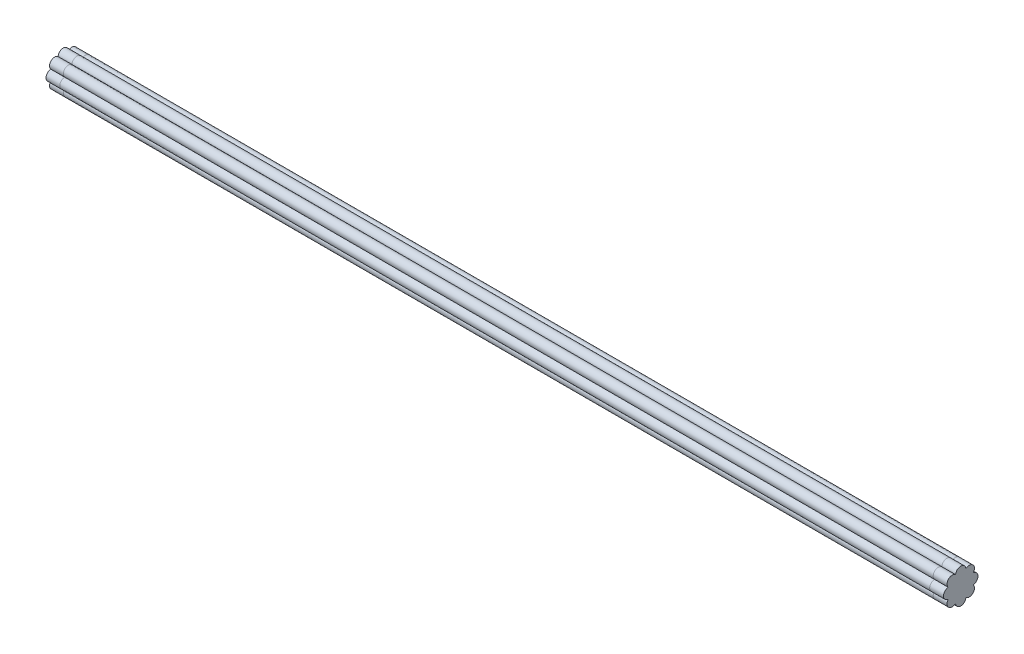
ISO-10303-21;
HEADER;
FILE_DESCRIPTION(('STEP AP214'),'2;1');
FILE_NAME('part.step','',(''),(''),'','','');
FILE_SCHEMA(('AUTOMOTIVE_DESIGN { 1 0 10303 214 1 1 1 1 }'));
ENDSEC;
DATA;
#1=APPLICATION_CONTEXT('core data for automotive mechanical design processes');
#2=APPLICATION_PROTOCOL_DEFINITION('international standard','automotive_design',2000,#1);
#3=PRODUCT_CONTEXT('',#1,'mechanical');
#4=PRODUCT('Part','Part','',(#3));
#5=PRODUCT_RELATED_PRODUCT_CATEGORY('part','',(#4));
#6=PRODUCT_DEFINITION_FORMATION('','',#4);
#7=PRODUCT_DEFINITION_CONTEXT('part definition',#1,'design');
#8=PRODUCT_DEFINITION('design','',#6,#7);
#9=PRODUCT_DEFINITION_SHAPE('','',#8);
#10=(LENGTH_UNIT() NAMED_UNIT(*) SI_UNIT(.MILLI.,.METRE.));
#11=(NAMED_UNIT(*) PLANE_ANGLE_UNIT() SI_UNIT($,.RADIAN.));
#12=(NAMED_UNIT(*) SI_UNIT($,.STERADIAN.) SOLID_ANGLE_UNIT());
#13=UNCERTAINTY_MEASURE_WITH_UNIT(LENGTH_MEASURE(1.E-05),#10,'distance_accuracy_value','');
#14=(GEOMETRIC_REPRESENTATION_CONTEXT(3) GLOBAL_UNCERTAINTY_ASSIGNED_CONTEXT((#13)) GLOBAL_UNIT_ASSIGNED_CONTEXT((#10,
#11,#12)) REPRESENTATION_CONTEXT('',''));
#15=CARTESIAN_POINT('',(0.,0.,0.));
#16=DIRECTION('',(0.,0.,1.));
#17=DIRECTION('',(1.,0.,0.));
#18=AXIS2_PLACEMENT_3D('',#15,#16,#17);
#19=CARTESIAN_POINT('',(650.,-1.49213974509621E-12,17.4999999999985));
#20=DIRECTION('',(-1.,0.,0.));
#21=DIRECTION('',(0.,0.,-1.));
#22=AXIS2_PLACEMENT_3D('',#19,#20,#21);
#23=CYLINDRICAL_SURFACE('',#22,7.5);
#24=CARTESIAN_POINT('',(630.,-1.49213974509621E-12,17.4999999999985));
#25=DIRECTION('',(-1.,0.,0.));
#26=DIRECTION('',(0.,0.,1.));
#27=AXIS2_PLACEMENT_3D('',#24,#25,#26);
#28=CIRCLE('',#27,7.5);
#29=CARTESIAN_POINT('',(630.,-7.47931344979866,18.0566599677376));
#30=VERTEX_POINT('',#29);
#31=CARTESIAN_POINT('',(630.,7.47931344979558,18.0566599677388));
#32=VERTEX_POINT('',#31);
#33=EDGE_CURVE('E139',#30,#32,#28,.T.);
#34=ORIENTED_EDGE('',*,*,#33,.F.);
#35=DIRECTION('',(-1.,0.,0.));
#36=VECTOR('',#35,1.);
#37=CARTESIAN_POINT('',(650.,-7.47931344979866,18.0566599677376));
#38=LINE('',#37,#36);
#39=CARTESIAN_POINT('',(650.,-7.47931344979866,18.0566599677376));
#40=VERTEX_POINT('',#39);
#41=EDGE_CURVE('E138',#40,#30,#38,.T.);
#42=ORIENTED_EDGE('',*,*,#41,.F.);
#43=CARTESIAN_POINT('',(650.,-1.49213974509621E-12,17.4999999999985));
#44=DIRECTION('',(-1.,0.,0.));
#45=DIRECTION('',(0.,0.,1.));
#46=AXIS2_PLACEMENT_3D('',#43,#44,#45);
#47=CIRCLE('',#46,7.5);
#48=CARTESIAN_POINT('',(650.,7.47931344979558,18.0566599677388));
#49=VERTEX_POINT('',#48);
#50=EDGE_CURVE('E157',#40,#49,#47,.T.);
#51=ORIENTED_EDGE('',*,*,#50,.T.);
#52=DIRECTION('',(-1.,0.,0.));
#53=VECTOR('',#52,1.);
#54=CARTESIAN_POINT('',(650.,7.47931344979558,18.0566599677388));
#55=LINE('',#54,#53);
#56=EDGE_CURVE('E12',#49,#32,#55,.T.);
#57=ORIENTED_EDGE('',*,*,#56,.T.);
#58=EDGE_LOOP('',(#34,#42,#51,#57));
#59=FACE_BOUND('',#58,.T.);
#60=ADVANCED_FACE('F43',(#59),#23,.T.);
#61=CARTESIAN_POINT('',(650.,12.3743686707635,12.3743686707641));
#62=DIRECTION('',(-1.,0.,0.));
#63=DIRECTION('',(0.,0.,-1.));
#64=AXIS2_PLACEMENT_3D('',#61,#62,#63);
#65=CYLINDRICAL_SURFACE('',#64,7.5);
#66=CARTESIAN_POINT('',(630.,12.3743686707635,12.3743686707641));
#67=DIRECTION('',(-1.,0.,0.));
#68=DIRECTION('',(0.,0.,1.));
#69=AXIS2_PLACEMENT_3D('',#66,#67,#68);
#70=CIRCLE('',#69,7.5);
#71=CARTESIAN_POINT('',(630.,18.0566599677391,7.47931344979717));
#72=VERTEX_POINT('',#71);
#73=EDGE_CURVE('E141',#32,#72,#70,.T.);
#74=ORIENTED_EDGE('',*,*,#73,.F.);
#75=ORIENTED_EDGE('',*,*,#56,.F.);
#76=CARTESIAN_POINT('',(650.,12.3743686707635,12.3743686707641));
#77=DIRECTION('',(-1.,0.,0.));
#78=DIRECTION('',(0.,0.,1.));
#79=AXIS2_PLACEMENT_3D('',#76,#77,#78);
#80=CIRCLE('',#79,7.5);
#81=CARTESIAN_POINT('',(650.,18.0566599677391,7.47931344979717));
#82=VERTEX_POINT('',#81);
#83=EDGE_CURVE('E97',#49,#82,#80,.T.);
#84=ORIENTED_EDGE('',*,*,#83,.T.);
#85=DIRECTION('',(-1.,0.,0.));
#86=VECTOR('',#85,1.);
#87=CARTESIAN_POINT('',(650.,18.0566599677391,7.47931344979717));
#88=LINE('',#87,#86);
#89=EDGE_CURVE('E51',#82,#72,#88,.T.);
#90=ORIENTED_EDGE('',*,*,#89,.T.);
#91=EDGE_LOOP('',(#74,#75,#84,#90));
#92=FACE_BOUND('',#91,.T.);
#93=ADVANCED_FACE('F169',(#92),#65,.T.);
#94=CARTESIAN_POINT('',(650.,17.5,0.));
#95=DIRECTION('',(-1.,0.,0.));
#96=DIRECTION('',(0.,0.,-1.));
#97=AXIS2_PLACEMENT_3D('',#94,#95,#96);
#98=CYLINDRICAL_SURFACE('',#97,7.50000000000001);
#99=CARTESIAN_POINT('',(630.,17.5,0.));
#100=DIRECTION('',(-1.,0.,0.));
#101=DIRECTION('',(0.,0.,1.));
#102=AXIS2_PLACEMENT_3D('',#99,#100,#101);
#103=CIRCLE('',#102,7.50000000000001);
#104=CARTESIAN_POINT('',(630.,18.0566599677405,-7.47931344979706));
#105=VERTEX_POINT('',#104);
#106=EDGE_CURVE('E144',#72,#105,#103,.T.);
#107=ORIENTED_EDGE('',*,*,#106,.F.);
#108=ORIENTED_EDGE('',*,*,#89,.F.);
#109=CARTESIAN_POINT('',(650.,17.5,0.));
#110=DIRECTION('',(-1.,0.,0.));
#111=DIRECTION('',(0.,0.,1.));
#112=AXIS2_PLACEMENT_3D('',#109,#110,#111);
#113=CIRCLE('',#112,7.50000000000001);
#114=CARTESIAN_POINT('',(650.,18.0566599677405,-7.47931344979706));
#115=VERTEX_POINT('',#114);
#116=EDGE_CURVE('E178',#82,#115,#113,.T.);
#117=ORIENTED_EDGE('',*,*,#116,.T.);
#118=DIRECTION('',(-1.,0.,0.));
#119=VECTOR('',#118,1.);
#120=CARTESIAN_POINT('',(650.,18.0566599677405,-7.47931344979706));
#121=LINE('',#120,#119);
#122=EDGE_CURVE('E164',#115,#105,#121,.T.);
#123=ORIENTED_EDGE('',*,*,#122,.T.);
#124=EDGE_LOOP('',(#107,#108,#117,#123));
#125=FACE_BOUND('',#124,.T.);
#126=ADVANCED_FACE('F188',(#125),#98,.T.);
#127=CARTESIAN_POINT('',(650.,12.3743686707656,-12.374368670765));
#128=DIRECTION('',(-1.,0.,0.));
#129=DIRECTION('',(0.,0.,-1.));
#130=AXIS2_PLACEMENT_3D('',#127,#128,#129);
#131=CYLINDRICAL_SURFACE('',#130,7.50000000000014);
#132=CARTESIAN_POINT('',(630.,12.3743686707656,-12.374368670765));
#133=DIRECTION('',(-1.,0.,0.));
#134=DIRECTION('',(0.,0.,1.));
#135=AXIS2_PLACEMENT_3D('',#132,#133,#134);
#136=CIRCLE('',#135,7.50000000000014);
#137=CARTESIAN_POINT('',(630.,7.47931344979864,-18.0566599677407));
#138=VERTEX_POINT('',#137);
#139=EDGE_CURVE('E147',#105,#138,#136,.T.);
#140=ORIENTED_EDGE('',*,*,#139,.F.);
#141=ORIENTED_EDGE('',*,*,#122,.F.);
#142=CARTESIAN_POINT('',(650.,12.3743686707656,-12.374368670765));
#143=DIRECTION('',(-1.,0.,0.));
#144=DIRECTION('',(0.,0.,1.));
#145=AXIS2_PLACEMENT_3D('',#142,#143,#144);
#146=CIRCLE('',#145,7.50000000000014);
#147=CARTESIAN_POINT('',(650.,7.47931344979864,-18.0566599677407));
#148=VERTEX_POINT('',#147);
#149=EDGE_CURVE('E133',#115,#148,#146,.T.);
#150=ORIENTED_EDGE('',*,*,#149,.T.);
#151=DIRECTION('',(-1.,0.,0.));
#152=VECTOR('',#151,1.);
#153=CARTESIAN_POINT('',(650.,7.47931344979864,-18.0566599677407));
#154=LINE('',#153,#152);
#155=EDGE_CURVE('E161',#148,#138,#154,.T.);
#156=ORIENTED_EDGE('',*,*,#155,.T.);
#157=EDGE_LOOP('',(#140,#141,#150,#156));
#158=FACE_BOUND('',#157,.T.);
#159=ADVANCED_FACE('F184',(#158),#131,.T.);
#160=CARTESIAN_POINT('',(650.,1.4899966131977E-12,-17.5000000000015));
#161=DIRECTION('',(-1.,0.,0.));
#162=DIRECTION('',(0.,0.,-1.));
#163=AXIS2_PLACEMENT_3D('',#160,#161,#162);
#164=CYLINDRICAL_SURFACE('',#163,7.5);
#165=CARTESIAN_POINT('',(630.,1.4899966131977E-12,-17.5000000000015));
#166=DIRECTION('',(-1.,0.,0.));
#167=DIRECTION('',(0.,0.,1.));
#168=AXIS2_PLACEMENT_3D('',#165,#166,#167);
#169=CIRCLE('',#168,7.5);
#170=CARTESIAN_POINT('',(630.,-7.47931344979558,-18.0566599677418));
#171=VERTEX_POINT('',#170);
#172=EDGE_CURVE('E150',#138,#171,#169,.T.);
#173=ORIENTED_EDGE('',*,*,#172,.F.);
#174=ORIENTED_EDGE('',*,*,#155,.F.);
#175=CARTESIAN_POINT('',(650.,1.4899966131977E-12,-17.5000000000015));
#176=DIRECTION('',(-1.,0.,0.));
#177=DIRECTION('',(0.,0.,1.));
#178=AXIS2_PLACEMENT_3D('',#175,#176,#177);
#179=CIRCLE('',#178,7.5);
#180=CARTESIAN_POINT('',(650.,-7.47931344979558,-18.0566599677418));
#181=VERTEX_POINT('',#180);
#182=EDGE_CURVE('E131',#148,#181,#179,.T.);
#183=ORIENTED_EDGE('',*,*,#182,.T.);
#184=DIRECTION('',(-1.,0.,0.));
#185=VECTOR('',#184,1.);
#186=CARTESIAN_POINT('',(650.,-7.47931344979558,-18.0566599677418));
#187=LINE('',#186,#185);
#188=EDGE_CURVE('E125',#181,#171,#187,.T.);
#189=ORIENTED_EDGE('',*,*,#188,.T.);
#190=EDGE_LOOP('',(#173,#174,#183,#189));
#191=FACE_BOUND('',#190,.T.);
#192=ADVANCED_FACE('F187',(#191),#164,.T.);
#193=CARTESIAN_POINT('',(650.,-12.3743686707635,-12.3743686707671));
#194=DIRECTION('',(-1.,0.,0.));
#195=DIRECTION('',(0.,0.,-1.));
#196=AXIS2_PLACEMENT_3D('',#193,#194,#195);
#197=CYLINDRICAL_SURFACE('',#196,7.5);
#198=CARTESIAN_POINT('',(630.,-12.3743686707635,-12.3743686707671));
#199=DIRECTION('',(-1.,0.,0.));
#200=DIRECTION('',(0.,0.,1.));
#201=AXIS2_PLACEMENT_3D('',#198,#199,#200);
#202=CIRCLE('',#201,7.5);
#203=CARTESIAN_POINT('',(630.,-18.0566599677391,-7.47931344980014));
#204=VERTEX_POINT('',#203);
#205=EDGE_CURVE('E153',#171,#204,#202,.T.);
#206=ORIENTED_EDGE('',*,*,#205,.F.);
#207=ORIENTED_EDGE('',*,*,#188,.F.);
#208=CARTESIAN_POINT('',(650.,-12.3743686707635,-12.3743686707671));
#209=DIRECTION('',(-1.,0.,0.));
#210=DIRECTION('',(0.,0.,1.));
#211=AXIS2_PLACEMENT_3D('',#208,#209,#210);
#212=CIRCLE('',#211,7.5);
#213=CARTESIAN_POINT('',(650.,-18.0566599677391,-7.47931344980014));
#214=VERTEX_POINT('',#213);
#215=EDGE_CURVE('E115',#181,#214,#212,.T.);
#216=ORIENTED_EDGE('',*,*,#215,.T.);
#217=DIRECTION('',(-1.,0.,0.));
#218=VECTOR('',#217,1.);
#219=CARTESIAN_POINT('',(650.,-18.0566599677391,-7.47931344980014));
#220=LINE('',#219,#218);
#221=EDGE_CURVE('E120',#214,#204,#220,.T.);
#222=ORIENTED_EDGE('',*,*,#221,.T.);
#223=EDGE_LOOP('',(#206,#207,#216,#222));
#224=FACE_BOUND('',#223,.T.);
#225=ADVANCED_FACE('F128',(#224),#197,.T.);
#226=CARTESIAN_POINT('',(650.,-17.5,-2.97999322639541E-12));
#227=DIRECTION('',(-1.,0.,0.));
#228=DIRECTION('',(0.,0.,-1.));
#229=AXIS2_PLACEMENT_3D('',#226,#227,#228);
#230=CYLINDRICAL_SURFACE('',#229,7.5);
#231=CARTESIAN_POINT('',(630.,-17.5,-2.97999322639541E-12));
#232=DIRECTION('',(-1.,0.,0.));
#233=DIRECTION('',(0.,0.,1.));
#234=AXIS2_PLACEMENT_3D('',#231,#232,#233);
#235=CIRCLE('',#234,7.5);
#236=CARTESIAN_POINT('',(630.,-18.0566599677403,7.47931344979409));
#237=VERTEX_POINT('',#236);
#238=EDGE_CURVE('E122',#204,#237,#235,.T.);
#239=ORIENTED_EDGE('',*,*,#238,.F.);
#240=ORIENTED_EDGE('',*,*,#221,.F.);
#241=CARTESIAN_POINT('',(650.,-17.5,-2.97999322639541E-12));
#242=DIRECTION('',(-1.,0.,0.));
#243=DIRECTION('',(0.,0.,1.));
#244=AXIS2_PLACEMENT_3D('',#241,#242,#243);
#245=CIRCLE('',#244,7.5);
#246=CARTESIAN_POINT('',(650.,-18.0566599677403,7.47931344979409));
#247=VERTEX_POINT('',#246);
#248=EDGE_CURVE('E111',#214,#247,#245,.T.);
#249=ORIENTED_EDGE('',*,*,#248,.T.);
#250=DIRECTION('',(-1.,0.,0.));
#251=VECTOR('',#250,1.);
#252=CARTESIAN_POINT('',(650.,-18.0566599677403,7.47931344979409));
#253=LINE('',#252,#251);
#254=EDGE_CURVE('E126',#247,#237,#253,.T.);
#255=ORIENTED_EDGE('',*,*,#254,.T.);
#256=EDGE_LOOP('',(#239,#240,#249,#255));
#257=FACE_BOUND('',#256,.T.);
#258=ADVANCED_FACE('F121',(#257),#230,.T.);
#259=CARTESIAN_POINT('',(650.,-12.3743686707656,12.374368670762));
#260=DIRECTION('',(-1.,0.,0.));
#261=DIRECTION('',(0.,0.,-1.));
#262=AXIS2_PLACEMENT_3D('',#259,#260,#261);
#263=CYLINDRICAL_SURFACE('',#262,7.5);
#264=CARTESIAN_POINT('',(630.,-12.3743686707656,12.374368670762));
#265=DIRECTION('',(-1.,0.,0.));
#266=DIRECTION('',(0.,0.,1.));
#267=AXIS2_PLACEMENT_3D('',#264,#265,#266);
#268=CIRCLE('',#267,7.5);
#269=EDGE_CURVE('E85',#237,#30,#268,.T.);
#270=ORIENTED_EDGE('',*,*,#269,.F.);
#271=ORIENTED_EDGE('',*,*,#254,.F.);
#272=CARTESIAN_POINT('',(650.,-12.3743686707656,12.374368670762));
#273=DIRECTION('',(-1.,0.,0.));
#274=DIRECTION('',(0.,0.,1.));
#275=AXIS2_PLACEMENT_3D('',#272,#273,#274);
#276=CIRCLE('',#275,7.5);
#277=EDGE_CURVE('E59',#247,#40,#276,.T.);
#278=ORIENTED_EDGE('',*,*,#277,.T.);
#279=ORIENTED_EDGE('',*,*,#41,.T.);
#280=EDGE_LOOP('',(#270,#271,#278,#279));
#281=FACE_BOUND('',#280,.T.);
#282=ADVANCED_FACE('F238',(#281),#263,.T.);
#283=CARTESIAN_POINT('',(650.,6.18718433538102,14.9371843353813));
#284=DIRECTION('',(1.,0.,0.));
#285=DIRECTION('',(0.,0.,1.));
#286=AXIS2_PLACEMENT_3D('',#283,#284,#285);
#287=PLANE('',#286);
#288=ORIENTED_EDGE('',*,*,#50,.F.);
#289=ORIENTED_EDGE('',*,*,#277,.F.);
#290=ORIENTED_EDGE('',*,*,#248,.F.);
#291=ORIENTED_EDGE('',*,*,#215,.F.);
#292=ORIENTED_EDGE('',*,*,#182,.F.);
#293=ORIENTED_EDGE('',*,*,#149,.F.);
#294=ORIENTED_EDGE('',*,*,#116,.F.);
#295=ORIENTED_EDGE('',*,*,#83,.F.);
#296=EDGE_LOOP('',(#288,#289,#290,#291,#292,#293,#294,#295));
#297=FACE_BOUND('',#296,.T.);
#298=ADVANCED_FACE('F113',(#297),#287,.T.);
#299=CARTESIAN_POINT('',(630.,6.18718433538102,14.9371843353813));
#300=DIRECTION('',(1.,0.,0.));
#301=DIRECTION('',(0.,0.,1.));
#302=AXIS2_PLACEMENT_3D('',#299,#300,#301);
#303=PLANE('',#302);
#304=ORIENTED_EDGE('',*,*,#33,.T.);
#305=ORIENTED_EDGE('',*,*,#73,.T.);
#306=ORIENTED_EDGE('',*,*,#106,.T.);
#307=ORIENTED_EDGE('',*,*,#139,.T.);
#308=ORIENTED_EDGE('',*,*,#172,.T.);
#309=ORIENTED_EDGE('',*,*,#205,.T.);
#310=ORIENTED_EDGE('',*,*,#238,.T.);
#311=ORIENTED_EDGE('',*,*,#269,.T.);
#312=EDGE_LOOP('',(#304,#305,#306,#307,#308,#309,#310,#311));
#313=FACE_BOUND('',#312,.T.);
#314=ADVANCED_FACE('F172',(#313),#303,.F.);
#315=CLOSED_SHELL('',(#60,#93,#126,#159,#192,#225,#258,#282,#298,#314));
#316=MANIFOLD_SOLID_BREP('B2',#315);
#317=CARTESIAN_POINT('',(-650.,-1.49213974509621E-12,17.4999999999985));
#318=DIRECTION('',(1.,0.,0.));
#319=DIRECTION('',(0.,0.,-1.));
#320=AXIS2_PLACEMENT_3D('',#317,#318,#319);
#321=CYLINDRICAL_SURFACE('',#320,7.5);
#322=CARTESIAN_POINT('',(-630.,-1.49213974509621E-12,17.4999999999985));
#323=DIRECTION('',(-1.,0.,0.));
#324=DIRECTION('',(0.,0.,1.));
#325=AXIS2_PLACEMENT_3D('',#322,#323,#324);
#326=CIRCLE('',#325,7.5);
#327=CARTESIAN_POINT('',(-630.,-7.47931344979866,18.0566599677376));
#328=VERTEX_POINT('',#327);
#329=CARTESIAN_POINT('',(-630.,7.47931344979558,18.0566599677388));
#330=VERTEX_POINT('',#329);
#331=EDGE_CURVE('E374',#328,#330,#326,.T.);
#332=ORIENTED_EDGE('',*,*,#331,.T.);
#333=DIRECTION('',(1.,0.,0.));
#334=VECTOR('',#333,1.);
#335=CARTESIAN_POINT('',(-650.,7.47931344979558,18.0566599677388));
#336=LINE('',#335,#334);
#337=CARTESIAN_POINT('',(-650.,7.47931344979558,18.0566599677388));
#338=VERTEX_POINT('',#337);
#339=EDGE_CURVE('E41',#338,#330,#336,.T.);
#340=ORIENTED_EDGE('',*,*,#339,.F.);
#341=CARTESIAN_POINT('',(-650.,-1.49213974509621E-12,17.4999999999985));
#342=DIRECTION('',(-1.,0.,0.));
#343=DIRECTION('',(0.,0.,1.));
#344=AXIS2_PLACEMENT_3D('',#341,#342,#343);
#345=CIRCLE('',#344,7.5);
#346=CARTESIAN_POINT('',(-650.,-7.47931344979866,18.0566599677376));
#347=VERTEX_POINT('',#346);
#348=EDGE_CURVE('E388',#347,#338,#345,.T.);
#349=ORIENTED_EDGE('',*,*,#348,.F.);
#350=DIRECTION('',(1.,0.,0.));
#351=VECTOR('',#350,1.);
#352=CARTESIAN_POINT('',(-650.,-7.47931344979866,18.0566599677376));
#353=LINE('',#352,#351);
#354=EDGE_CURVE('E370',#347,#328,#353,.T.);
#355=ORIENTED_EDGE('',*,*,#354,.T.);
#356=EDGE_LOOP('',(#332,#340,#349,#355));
#357=FACE_BOUND('',#356,.T.);
#358=ADVANCED_FACE('F278',(#357),#321,.T.);
#359=CARTESIAN_POINT('',(-650.,12.3743686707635,12.3743686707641));
#360=DIRECTION('',(1.,0.,0.));
#361=DIRECTION('',(0.,0.,-1.));
#362=AXIS2_PLACEMENT_3D('',#359,#360,#361);
#363=CYLINDRICAL_SURFACE('',#362,7.5);
#364=CARTESIAN_POINT('',(-630.,12.3743686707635,12.3743686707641));
#365=DIRECTION('',(-1.,0.,0.));
#366=DIRECTION('',(0.,0.,1.));
#367=AXIS2_PLACEMENT_3D('',#364,#365,#366);
#368=CIRCLE('',#367,7.5);
#369=CARTESIAN_POINT('',(-630.,18.0566599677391,7.47931344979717));
#370=VERTEX_POINT('',#369);
#371=EDGE_CURVE('E377',#330,#370,#368,.T.);
#372=ORIENTED_EDGE('',*,*,#371,.T.);
#373=DIRECTION('',(1.,0.,0.));
#374=VECTOR('',#373,1.);
#375=CARTESIAN_POINT('',(-650.,18.0566599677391,7.47931344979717));
#376=LINE('',#375,#374);
#377=CARTESIAN_POINT('',(-650.,18.0566599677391,7.47931344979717));
#378=VERTEX_POINT('',#377);
#379=EDGE_CURVE('E286',#378,#370,#376,.T.);
#380=ORIENTED_EDGE('',*,*,#379,.F.);
#381=CARTESIAN_POINT('',(-650.,12.3743686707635,12.3743686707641));
#382=DIRECTION('',(-1.,0.,0.));
#383=DIRECTION('',(0.,0.,1.));
#384=AXIS2_PLACEMENT_3D('',#381,#382,#383);
#385=CIRCLE('',#384,7.5);
#386=EDGE_CURVE('E337',#338,#378,#385,.T.);
#387=ORIENTED_EDGE('',*,*,#386,.F.);
#388=ORIENTED_EDGE('',*,*,#339,.T.);
#389=EDGE_LOOP('',(#372,#380,#387,#388));
#390=FACE_BOUND('',#389,.T.);
#391=ADVANCED_FACE('F423',(#390),#363,.T.);
#392=CARTESIAN_POINT('',(-650.,17.5,0.));
#393=DIRECTION('',(1.,0.,0.));
#394=DIRECTION('',(0.,0.,-1.));
#395=AXIS2_PLACEMENT_3D('',#392,#393,#394);
#396=CYLINDRICAL_SURFACE('',#395,7.50000000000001);
#397=CARTESIAN_POINT('',(-630.,17.5,0.));
#398=DIRECTION('',(-1.,0.,0.));
#399=DIRECTION('',(0.,0.,1.));
#400=AXIS2_PLACEMENT_3D('',#397,#398,#399);
#401=CIRCLE('',#400,7.50000000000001);
#402=CARTESIAN_POINT('',(-630.,18.0566599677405,-7.47931344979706));
#403=VERTEX_POINT('',#402);
#404=EDGE_CURVE('E379',#370,#403,#401,.T.);
#405=ORIENTED_EDGE('',*,*,#404,.T.);
#406=DIRECTION('',(1.,0.,0.));
#407=VECTOR('',#406,1.);
#408=CARTESIAN_POINT('',(-650.,18.0566599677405,-7.47931344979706));
#409=LINE('',#408,#407);
#410=CARTESIAN_POINT('',(-650.,18.0566599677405,-7.47931344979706));
#411=VERTEX_POINT('',#410);
#412=EDGE_CURVE('E395',#411,#403,#409,.T.);
#413=ORIENTED_EDGE('',*,*,#412,.F.);
#414=CARTESIAN_POINT('',(-650.,17.5,0.));
#415=DIRECTION('',(-1.,0.,0.));
#416=DIRECTION('',(0.,0.,1.));
#417=AXIS2_PLACEMENT_3D('',#414,#415,#416);
#418=CIRCLE('',#417,7.50000000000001);
#419=EDGE_CURVE('E403',#378,#411,#418,.T.);
#420=ORIENTED_EDGE('',*,*,#419,.F.);
#421=ORIENTED_EDGE('',*,*,#379,.T.);
#422=EDGE_LOOP('',(#405,#413,#420,#421));
#423=FACE_BOUND('',#422,.T.);
#424=ADVANCED_FACE('F401',(#423),#396,.T.);
#425=CARTESIAN_POINT('',(-650.,12.3743686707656,-12.374368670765));
#426=DIRECTION('',(1.,0.,0.));
#427=DIRECTION('',(0.,0.,-1.));
#428=AXIS2_PLACEMENT_3D('',#425,#426,#427);
#429=CYLINDRICAL_SURFACE('',#428,7.50000000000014);
#430=CARTESIAN_POINT('',(-630.,12.3743686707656,-12.374368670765));
#431=DIRECTION('',(-1.,0.,0.));
#432=DIRECTION('',(0.,0.,1.));
#433=AXIS2_PLACEMENT_3D('',#430,#431,#432);
#434=CIRCLE('',#433,7.50000000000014);
#435=CARTESIAN_POINT('',(-630.,7.47931344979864,-18.0566599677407));
#436=VERTEX_POINT('',#435);
#437=EDGE_CURVE('E381',#403,#436,#434,.T.);
#438=ORIENTED_EDGE('',*,*,#437,.T.);
#439=DIRECTION('',(1.,0.,0.));
#440=VECTOR('',#439,1.);
#441=CARTESIAN_POINT('',(-650.,7.47931344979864,-18.0566599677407));
#442=LINE('',#441,#440);
#443=CARTESIAN_POINT('',(-650.,7.47931344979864,-18.0566599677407));
#444=VERTEX_POINT('',#443);
#445=EDGE_CURVE('E392',#444,#436,#442,.T.);
#446=ORIENTED_EDGE('',*,*,#445,.F.);
#447=CARTESIAN_POINT('',(-650.,12.3743686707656,-12.374368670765));
#448=DIRECTION('',(-1.,0.,0.));
#449=DIRECTION('',(0.,0.,1.));
#450=AXIS2_PLACEMENT_3D('',#447,#448,#449);
#451=CIRCLE('',#450,7.50000000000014);
#452=EDGE_CURVE('E415',#411,#444,#451,.T.);
#453=ORIENTED_EDGE('',*,*,#452,.F.);
#454=ORIENTED_EDGE('',*,*,#412,.T.);
#455=EDGE_LOOP('',(#438,#446,#453,#454));
#456=FACE_BOUND('',#455,.T.);
#457=ADVANCED_FACE('F411',(#456),#429,.T.);
#458=CARTESIAN_POINT('',(-650.,1.4899966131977E-12,-17.5000000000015));
#459=DIRECTION('',(1.,0.,0.));
#460=DIRECTION('',(0.,0.,-1.));
#461=AXIS2_PLACEMENT_3D('',#458,#459,#460);
#462=CYLINDRICAL_SURFACE('',#461,7.5);
#463=CARTESIAN_POINT('',(-630.,1.4899966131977E-12,-17.5000000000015));
#464=DIRECTION('',(-1.,0.,0.));
#465=DIRECTION('',(0.,0.,1.));
#466=AXIS2_PLACEMENT_3D('',#463,#464,#465);
#467=CIRCLE('',#466,7.5);
#468=CARTESIAN_POINT('',(-630.,-7.47931344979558,-18.0566599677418));
#469=VERTEX_POINT('',#468);
#470=EDGE_CURVE('E383',#436,#469,#467,.T.);
#471=ORIENTED_EDGE('',*,*,#470,.T.);
#472=DIRECTION('',(1.,0.,0.));
#473=VECTOR('',#472,1.);
#474=CARTESIAN_POINT('',(-650.,-7.47931344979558,-18.0566599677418));
#475=LINE('',#474,#473);
#476=CARTESIAN_POINT('',(-650.,-7.47931344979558,-18.0566599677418));
#477=VERTEX_POINT('',#476);
#478=EDGE_CURVE('E365',#477,#469,#475,.T.);
#479=ORIENTED_EDGE('',*,*,#478,.F.);
#480=CARTESIAN_POINT('',(-650.,1.4899966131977E-12,-17.5000000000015));
#481=DIRECTION('',(-1.,0.,0.));
#482=DIRECTION('',(0.,0.,1.));
#483=AXIS2_PLACEMENT_3D('',#480,#481,#482);
#484=CIRCLE('',#483,7.5);
#485=EDGE_CURVE('E356',#444,#477,#484,.T.);
#486=ORIENTED_EDGE('',*,*,#485,.F.);
#487=ORIENTED_EDGE('',*,*,#445,.T.);
#488=EDGE_LOOP('',(#471,#479,#486,#487));
#489=FACE_BOUND('',#488,.T.);
#490=ADVANCED_FACE('F414',(#489),#462,.T.);
#491=CARTESIAN_POINT('',(-650.,-12.3743686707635,-12.3743686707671));
#492=DIRECTION('',(1.,0.,0.));
#493=DIRECTION('',(0.,0.,-1.));
#494=AXIS2_PLACEMENT_3D('',#491,#492,#493);
#495=CYLINDRICAL_SURFACE('',#494,7.5);
#496=CARTESIAN_POINT('',(-630.,-12.3743686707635,-12.3743686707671));
#497=DIRECTION('',(-1.,0.,0.));
#498=DIRECTION('',(0.,0.,1.));
#499=AXIS2_PLACEMENT_3D('',#496,#497,#498);
#500=CIRCLE('',#499,7.5);
#501=CARTESIAN_POINT('',(-630.,-18.0566599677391,-7.47931344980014));
#502=VERTEX_POINT('',#501);
#503=EDGE_CURVE('E364',#469,#502,#500,.T.);
#504=ORIENTED_EDGE('',*,*,#503,.T.);
#505=DIRECTION('',(1.,0.,0.));
#506=VECTOR('',#505,1.);
#507=CARTESIAN_POINT('',(-650.,-18.0566599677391,-7.47931344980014));
#508=LINE('',#507,#506);
#509=CARTESIAN_POINT('',(-650.,-18.0566599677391,-7.47931344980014));
#510=VERTEX_POINT('',#509);
#511=EDGE_CURVE('E361',#510,#502,#508,.T.);
#512=ORIENTED_EDGE('',*,*,#511,.F.);
#513=CARTESIAN_POINT('',(-650.,-12.3743686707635,-12.3743686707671));
#514=DIRECTION('',(-1.,0.,0.));
#515=DIRECTION('',(0.,0.,1.));
#516=AXIS2_PLACEMENT_3D('',#513,#514,#515);
#517=CIRCLE('',#516,7.5);
#518=EDGE_CURVE('E350',#477,#510,#517,.T.);
#519=ORIENTED_EDGE('',*,*,#518,.F.);
#520=ORIENTED_EDGE('',*,*,#478,.T.);
#521=EDGE_LOOP('',(#504,#512,#519,#520));
#522=FACE_BOUND('',#521,.T.);
#523=ADVANCED_FACE('F362',(#522),#495,.T.);
#524=CARTESIAN_POINT('',(-650.,-17.5,-2.97999322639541E-12));
#525=DIRECTION('',(1.,0.,0.));
#526=DIRECTION('',(0.,0.,-1.));
#527=AXIS2_PLACEMENT_3D('',#524,#525,#526);
#528=CYLINDRICAL_SURFACE('',#527,7.5);
#529=CARTESIAN_POINT('',(-630.,-17.5,-2.97999322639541E-12));
#530=DIRECTION('',(-1.,0.,0.));
#531=DIRECTION('',(0.,0.,1.));
#532=AXIS2_PLACEMENT_3D('',#529,#530,#531);
#533=CIRCLE('',#532,7.5);
#534=CARTESIAN_POINT('',(-630.,-18.0566599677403,7.47931344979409));
#535=VERTEX_POINT('',#534);
#536=EDGE_CURVE('E323',#502,#535,#533,.T.);
#537=ORIENTED_EDGE('',*,*,#536,.T.);
#538=DIRECTION('',(1.,0.,0.));
#539=VECTOR('',#538,1.);
#540=CARTESIAN_POINT('',(-650.,-18.0566599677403,7.47931344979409));
#541=LINE('',#540,#539);
#542=CARTESIAN_POINT('',(-650.,-18.0566599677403,7.47931344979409));
#543=VERTEX_POINT('',#542);
#544=EDGE_CURVE('E366',#543,#535,#541,.T.);
#545=ORIENTED_EDGE('',*,*,#544,.F.);
#546=CARTESIAN_POINT('',(-650.,-17.5,-2.97999322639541E-12));
#547=DIRECTION('',(-1.,0.,0.));
#548=DIRECTION('',(0.,0.,1.));
#549=AXIS2_PLACEMENT_3D('',#546,#547,#548);
#550=CIRCLE('',#549,7.5);
#551=EDGE_CURVE('E354',#510,#543,#550,.T.);
#552=ORIENTED_EDGE('',*,*,#551,.F.);
#553=ORIENTED_EDGE('',*,*,#511,.T.);
#554=EDGE_LOOP('',(#537,#545,#552,#553));
#555=FACE_BOUND('',#554,.T.);
#556=ADVANCED_FACE('F368',(#555),#528,.T.);
#557=CARTESIAN_POINT('',(-650.,-12.3743686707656,12.374368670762));
#558=DIRECTION('',(1.,0.,0.));
#559=DIRECTION('',(0.,0.,-1.));
#560=AXIS2_PLACEMENT_3D('',#557,#558,#559);
#561=CYLINDRICAL_SURFACE('',#560,7.5);
#562=CARTESIAN_POINT('',(-630.,-12.3743686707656,12.374368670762));
#563=DIRECTION('',(-1.,0.,0.));
#564=DIRECTION('',(0.,0.,1.));
#565=AXIS2_PLACEMENT_3D('',#562,#563,#564);
#566=CIRCLE('',#565,7.5);
#567=EDGE_CURVE('E329',#535,#328,#566,.T.);
#568=ORIENTED_EDGE('',*,*,#567,.T.);
#569=ORIENTED_EDGE('',*,*,#354,.F.);
#570=CARTESIAN_POINT('',(-650.,-12.3743686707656,12.374368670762));
#571=DIRECTION('',(-1.,0.,0.));
#572=DIRECTION('',(0.,0.,1.));
#573=AXIS2_PLACEMENT_3D('',#570,#571,#572);
#574=CIRCLE('',#573,7.5);
#575=EDGE_CURVE('E294',#543,#347,#574,.T.);
#576=ORIENTED_EDGE('',*,*,#575,.F.);
#577=ORIENTED_EDGE('',*,*,#544,.T.);
#578=EDGE_LOOP('',(#568,#569,#576,#577));
#579=FACE_BOUND('',#578,.T.);
#580=ADVANCED_FACE('F439',(#579),#561,.T.);
#581=CARTESIAN_POINT('',(-650.,6.18718433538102,14.9371843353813));
#582=DIRECTION('',(-1.,0.,0.));
#583=DIRECTION('',(0.,0.,1.));
#584=AXIS2_PLACEMENT_3D('',#581,#582,#583);
#585=PLANE('',#584);
#586=ORIENTED_EDGE('',*,*,#348,.T.);
#587=ORIENTED_EDGE('',*,*,#386,.T.);
#588=ORIENTED_EDGE('',*,*,#419,.T.);
#589=ORIENTED_EDGE('',*,*,#452,.T.);
#590=ORIENTED_EDGE('',*,*,#485,.T.);
#591=ORIENTED_EDGE('',*,*,#518,.T.);
#592=ORIENTED_EDGE('',*,*,#551,.T.);
#593=ORIENTED_EDGE('',*,*,#575,.T.);
#594=EDGE_LOOP('',(#586,#587,#588,#589,#590,#591,#592,#593));
#595=FACE_BOUND('',#594,.T.);
#596=ADVANCED_FACE('F352',(#595),#585,.T.);
#597=CARTESIAN_POINT('',(-630.,6.18718433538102,14.9371843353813));
#598=DIRECTION('',(-1.,0.,0.));
#599=DIRECTION('',(0.,0.,1.));
#600=AXIS2_PLACEMENT_3D('',#597,#598,#599);
#601=PLANE('',#600);
#602=ORIENTED_EDGE('',*,*,#331,.F.);
#603=ORIENTED_EDGE('',*,*,#567,.F.);
#604=ORIENTED_EDGE('',*,*,#536,.F.);
#605=ORIENTED_EDGE('',*,*,#503,.F.);
#606=ORIENTED_EDGE('',*,*,#470,.F.);
#607=ORIENTED_EDGE('',*,*,#437,.F.);
#608=ORIENTED_EDGE('',*,*,#404,.F.);
#609=ORIENTED_EDGE('',*,*,#371,.F.);
#610=EDGE_LOOP('',(#602,#603,#604,#605,#606,#607,#608,#609));
#611=FACE_BOUND('',#610,.T.);
#612=ADVANCED_FACE('F407',(#611),#601,.F.);
#613=CLOSED_SHELL('',(#358,#391,#424,#457,#490,#523,#556,#580,#596,#612));
#614=MANIFOLD_SOLID_BREP('B6',#613);
#615=CARTESIAN_POINT('',(-630.,-17.5,-2.97999322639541E-12));
#616=DIRECTION('',(1.,0.,0.));
#617=DIRECTION('',(0.,0.,-1.));
#618=AXIS2_PLACEMENT_3D('',#615,#616,#617);
#619=CYLINDRICAL_SURFACE('',#618,7.5);
#620=CARTESIAN_POINT('',(-630.,-17.5,-2.97999322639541E-12));
#621=DIRECTION('',(1.,0.,0.));
#622=DIRECTION('',(0.,0.,-1.));
#623=AXIS2_PLACEMENT_3D('',#620,#621,#622);
#624=CIRCLE('',#623,7.5);
#625=CARTESIAN_POINT('',(-630.,-17.5,-7.50000000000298));
#626=VERTEX_POINT('',#625);
#627=EDGE_CURVE('E277',#626,#626,#624,.T.);
#628=ORIENTED_EDGE('',*,*,#627,.T.);
#629=EDGE_LOOP('',(#628));
#630=FACE_BOUND('',#629,.T.);
#631=CARTESIAN_POINT('',(630.,-17.5,-2.97999322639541E-12));
#632=DIRECTION('',(1.,0.,0.));
#633=DIRECTION('',(0.,0.,-1.));
#634=AXIS2_PLACEMENT_3D('',#631,#632,#633);
#635=CIRCLE('',#634,7.5);
#636=CARTESIAN_POINT('',(630.,-17.5,-7.50000000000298));
#637=VERTEX_POINT('',#636);
#638=EDGE_CURVE('E520',#637,#637,#635,.T.);
#639=ORIENTED_EDGE('',*,*,#638,.F.);
#640=EDGE_LOOP('',(#639));
#641=FACE_BOUND('',#640,.T.);
#642=ADVANCED_FACE('F514',(#630,#641),#619,.T.);
#643=CARTESIAN_POINT('',(-630.,-17.5,-2.97999322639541E-12));
#644=DIRECTION('',(1.,0.,0.));
#645=DIRECTION('',(0.,0.,-1.));
#646=AXIS2_PLACEMENT_3D('',#643,#644,#645);
#647=PLANE('',#646);
#648=ORIENTED_EDGE('',*,*,#627,.F.);
#649=EDGE_LOOP('',(#648));
#650=FACE_BOUND('',#649,.T.);
#651=ADVANCED_FACE('F529',(#650),#647,.F.);
#652=CARTESIAN_POINT('',(630.,-17.5,-2.97999322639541E-12));
#653=DIRECTION('',(1.,0.,0.));
#654=DIRECTION('',(0.,0.,-1.));
#655=AXIS2_PLACEMENT_3D('',#652,#653,#654);
#656=PLANE('',#655);
#657=ORIENTED_EDGE('',*,*,#638,.T.);
#658=EDGE_LOOP('',(#657));
#659=FACE_BOUND('',#658,.T.);
#660=ADVANCED_FACE('F526',(#659),#656,.T.);
#661=CLOSED_SHELL('',(#642,#651,#660));
#662=MANIFOLD_SOLID_BREP('B35',#661);
#663=CARTESIAN_POINT('',(-630.,12.3743686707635,12.3743686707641));
#664=DIRECTION('',(1.,0.,0.));
#665=DIRECTION('',(0.,0.,-1.));
#666=AXIS2_PLACEMENT_3D('',#663,#664,#665);
#667=CYLINDRICAL_SURFACE('',#666,7.5);
#668=DIRECTION('',(1.,0.,0.));
#669=VECTOR('',#668,1.);
#670=CARTESIAN_POINT('',(-630.,7.47931344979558,18.0566599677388));
#671=LINE('',#670,#669);
#672=CARTESIAN_POINT('',(-630.,7.47931344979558,18.0566599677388));
#673=VERTEX_POINT('',#672);
#674=CARTESIAN_POINT('',(630.,7.47931344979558,18.0566599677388));
#675=VERTEX_POINT('',#674);
#676=EDGE_CURVE('E557',#673,#675,#671,.T.);
#677=ORIENTED_EDGE('',*,*,#676,.T.);
#678=CARTESIAN_POINT('',(630.,12.3743686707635,12.3743686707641));
#679=DIRECTION('',(1.,0.,0.));
#680=DIRECTION('',(0.,0.,-1.));
#681=AXIS2_PLACEMENT_3D('',#678,#679,#680);
#682=CIRCLE('',#681,7.5);
#683=CARTESIAN_POINT('',(630.,18.0566599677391,7.47931344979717));
#684=VERTEX_POINT('',#683);
#685=EDGE_CURVE('E618',#684,#675,#682,.T.);
#686=ORIENTED_EDGE('',*,*,#685,.F.);
#687=DIRECTION('',(1.,0.,0.));
#688=VECTOR('',#687,1.);
#689=CARTESIAN_POINT('',(-630.,18.0566599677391,7.47931344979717));
#690=LINE('',#689,#688);
#691=CARTESIAN_POINT('',(-630.,18.0566599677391,7.47931344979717));
#692=VERTEX_POINT('',#691);
#693=EDGE_CURVE('E512',#692,#684,#690,.T.);
#694=ORIENTED_EDGE('',*,*,#693,.F.);
#695=CARTESIAN_POINT('',(-630.,12.3743686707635,12.3743686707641));
#696=DIRECTION('',(1.,0.,0.));
#697=DIRECTION('',(0.,0.,-1.));
#698=AXIS2_PLACEMENT_3D('',#695,#696,#697);
#699=CIRCLE('',#698,7.5);
#700=EDGE_CURVE('E619',#692,#673,#699,.T.);
#701=ORIENTED_EDGE('',*,*,#700,.T.);
#702=EDGE_LOOP('',(#677,#686,#694,#701));
#703=FACE_BOUND('',#702,.T.);
#704=ADVANCED_FACE('F554',(#703),#667,.T.);
#705=CARTESIAN_POINT('',(-630.,17.5,0.));
#706=DIRECTION('',(1.,0.,0.));
#707=DIRECTION('',(0.,0.,-1.));
#708=AXIS2_PLACEMENT_3D('',#705,#706,#707);
#709=CYLINDRICAL_SURFACE('',#708,7.50000000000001);
#710=ORIENTED_EDGE('',*,*,#693,.T.);
#711=CARTESIAN_POINT('',(630.,17.5,0.));
#712=DIRECTION('',(1.,0.,0.));
#713=DIRECTION('',(0.,0.,-1.));
#714=AXIS2_PLACEMENT_3D('',#711,#712,#713);
#715=CIRCLE('',#714,7.50000000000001);
#716=CARTESIAN_POINT('',(630.,18.0566599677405,-7.47931344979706));
#717=VERTEX_POINT('',#716);
#718=EDGE_CURVE('E636',#717,#684,#715,.T.);
#719=ORIENTED_EDGE('',*,*,#718,.F.);
#720=DIRECTION('',(1.,0.,0.));
#721=VECTOR('',#720,1.);
#722=CARTESIAN_POINT('',(-630.,18.0566599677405,-7.47931344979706));
#723=LINE('',#722,#721);
#724=CARTESIAN_POINT('',(-630.,18.0566599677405,-7.47931344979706));
#725=VERTEX_POINT('',#724);
#726=EDGE_CURVE('E562',#725,#717,#723,.T.);
#727=ORIENTED_EDGE('',*,*,#726,.F.);
#728=CARTESIAN_POINT('',(-630.,17.5,0.));
#729=DIRECTION('',(1.,0.,0.));
#730=DIRECTION('',(0.,0.,-1.));
#731=AXIS2_PLACEMENT_3D('',#728,#729,#730);
#732=CIRCLE('',#731,7.50000000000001);
#733=EDGE_CURVE('E624',#725,#692,#732,.T.);
#734=ORIENTED_EDGE('',*,*,#733,.T.);
#735=EDGE_LOOP('',(#710,#719,#727,#734));
#736=FACE_BOUND('',#735,.T.);
#737=ADVANCED_FACE('F700',(#736),#709,.T.);
#738=CARTESIAN_POINT('',(-630.,12.3743686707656,-12.374368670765));
#739=DIRECTION('',(1.,0.,0.));
#740=DIRECTION('',(0.,0.,-1.));
#741=AXIS2_PLACEMENT_3D('',#738,#739,#740);
#742=CYLINDRICAL_SURFACE('',#741,7.50000000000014);
#743=ORIENTED_EDGE('',*,*,#726,.T.);
#744=CARTESIAN_POINT('',(630.,12.3743686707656,-12.374368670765));
#745=DIRECTION('',(1.,0.,0.));
#746=DIRECTION('',(0.,0.,-1.));
#747=AXIS2_PLACEMENT_3D('',#744,#745,#746);
#748=CIRCLE('',#747,7.50000000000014);
#749=CARTESIAN_POINT('',(630.,7.47931344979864,-18.0566599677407));
#750=VERTEX_POINT('',#749);
#751=EDGE_CURVE('E649',#750,#717,#748,.T.);
#752=ORIENTED_EDGE('',*,*,#751,.F.);
#753=DIRECTION('',(1.,0.,0.));
#754=VECTOR('',#753,1.);
#755=CARTESIAN_POINT('',(-630.,7.47931344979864,-18.0566599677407));
#756=LINE('',#755,#754);
#757=CARTESIAN_POINT('',(-630.,7.47931344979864,-18.0566599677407));
#758=VERTEX_POINT('',#757);
#759=EDGE_CURVE('E671',#758,#750,#756,.T.);
#760=ORIENTED_EDGE('',*,*,#759,.F.);
#761=CARTESIAN_POINT('',(-630.,12.3743686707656,-12.374368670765));
#762=DIRECTION('',(1.,0.,0.));
#763=DIRECTION('',(0.,0.,-1.));
#764=AXIS2_PLACEMENT_3D('',#761,#762,#763);
#765=CIRCLE('',#764,7.50000000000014);
#766=EDGE_CURVE('E667',#758,#725,#765,.T.);
#767=ORIENTED_EDGE('',*,*,#766,.T.);
#768=EDGE_LOOP('',(#743,#752,#760,#767));
#769=FACE_BOUND('',#768,.T.);
#770=ADVANCED_FACE('F699',(#769),#742,.T.);
#771=CARTESIAN_POINT('',(-630.,1.4899966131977E-12,-17.5000000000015));
#772=DIRECTION('',(1.,0.,0.));
#773=DIRECTION('',(0.,0.,-1.));
#774=AXIS2_PLACEMENT_3D('',#771,#772,#773);
#775=CYLINDRICAL_SURFACE('',#774,7.5);
#776=ORIENTED_EDGE('',*,*,#759,.T.);
#777=CARTESIAN_POINT('',(630.,1.4899966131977E-12,-17.5000000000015));
#778=DIRECTION('',(1.,0.,0.));
#779=DIRECTION('',(0.,0.,-1.));
#780=AXIS2_PLACEMENT_3D('',#777,#778,#779);
#781=CIRCLE('',#780,7.5);
#782=CARTESIAN_POINT('',(630.,-7.47931344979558,-18.0566599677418));
#783=VERTEX_POINT('',#782);
#784=EDGE_CURVE('E646',#783,#750,#781,.T.);
#785=ORIENTED_EDGE('',*,*,#784,.F.);
#786=DIRECTION('',(1.,0.,0.));
#787=VECTOR('',#786,1.);
#788=CARTESIAN_POINT('',(-630.,-7.47931344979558,-18.0566599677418));
#789=LINE('',#788,#787);
#790=CARTESIAN_POINT('',(-630.,-7.47931344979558,-18.0566599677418));
#791=VERTEX_POINT('',#790);
#792=EDGE_CURVE('E673',#791,#783,#789,.T.);
#793=ORIENTED_EDGE('',*,*,#792,.F.);
#794=CARTESIAN_POINT('',(-630.,1.4899966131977E-12,-17.5000000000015));
#795=DIRECTION('',(1.,0.,0.));
#796=DIRECTION('',(0.,0.,-1.));
#797=AXIS2_PLACEMENT_3D('',#794,#795,#796);
#798=CIRCLE('',#797,7.5);
#799=EDGE_CURVE('E664',#791,#758,#798,.T.);
#800=ORIENTED_EDGE('',*,*,#799,.T.);
#801=EDGE_LOOP('',(#776,#785,#793,#800));
#802=FACE_BOUND('',#801,.T.);
#803=ADVANCED_FACE('F695',(#802),#775,.T.);
#804=CARTESIAN_POINT('',(-630.,-12.3743686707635,-12.3743686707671));
#805=DIRECTION('',(1.,0.,0.));
#806=DIRECTION('',(0.,0.,-1.));
#807=AXIS2_PLACEMENT_3D('',#804,#805,#806);
#808=CYLINDRICAL_SURFACE('',#807,7.5);
#809=ORIENTED_EDGE('',*,*,#792,.T.);
#810=CARTESIAN_POINT('',(630.,-12.3743686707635,-12.3743686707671));
#811=DIRECTION('',(1.,0.,0.));
#812=DIRECTION('',(0.,0.,-1.));
#813=AXIS2_PLACEMENT_3D('',#810,#811,#812);
#814=CIRCLE('',#813,7.5);
#815=CARTESIAN_POINT('',(630.,-18.0566599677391,-7.47931344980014));
#816=VERTEX_POINT('',#815);
#817=EDGE_CURVE('E643',#816,#783,#814,.T.);
#818=ORIENTED_EDGE('',*,*,#817,.F.);
#819=DIRECTION('',(1.,0.,0.));
#820=VECTOR('',#819,1.);
#821=CARTESIAN_POINT('',(-630.,-18.0566599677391,-7.47931344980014));
#822=LINE('',#821,#820);
#823=CARTESIAN_POINT('',(-630.,-18.0566599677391,-7.47931344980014));
#824=VERTEX_POINT('',#823);
#825=EDGE_CURVE('E675',#824,#816,#822,.T.);
#826=ORIENTED_EDGE('',*,*,#825,.F.);
#827=CARTESIAN_POINT('',(-630.,-12.3743686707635,-12.3743686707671));
#828=DIRECTION('',(1.,0.,0.));
#829=DIRECTION('',(0.,0.,-1.));
#830=AXIS2_PLACEMENT_3D('',#827,#828,#829);
#831=CIRCLE('',#830,7.5);
#832=EDGE_CURVE('E661',#824,#791,#831,.T.);
#833=ORIENTED_EDGE('',*,*,#832,.T.);
#834=EDGE_LOOP('',(#809,#818,#826,#833));
#835=FACE_BOUND('',#834,.T.);
#836=ADVANCED_FACE('F688',(#835),#808,.T.);
#837=CARTESIAN_POINT('',(-630.,-17.5,-2.97999322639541E-12));
#838=DIRECTION('',(1.,0.,0.));
#839=DIRECTION('',(0.,0.,-1.));
#840=AXIS2_PLACEMENT_3D('',#837,#838,#839);
#841=CYLINDRICAL_SURFACE('',#840,7.5);
#842=ORIENTED_EDGE('',*,*,#825,.T.);
#843=CARTESIAN_POINT('',(630.,-17.5,-2.97999322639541E-12));
#844=DIRECTION('',(-1.,0.,0.));
#845=DIRECTION('',(0.,0.,-1.));
#846=AXIS2_PLACEMENT_3D('',#843,#844,#845);
#847=CIRCLE('',#846,7.5);
#848=CARTESIAN_POINT('',(630.,-18.0566599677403,7.47931344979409));
#849=VERTEX_POINT('',#848);
#850=EDGE_CURVE('E640',#849,#816,#847,.T.);
#851=ORIENTED_EDGE('',*,*,#850,.F.);
#852=DIRECTION('',(1.,0.,0.));
#853=VECTOR('',#852,1.);
#854=CARTESIAN_POINT('',(-630.,-18.0566599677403,7.47931344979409));
#855=LINE('',#854,#853);
#856=CARTESIAN_POINT('',(-630.,-18.0566599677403,7.47931344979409));
#857=VERTEX_POINT('',#856);
#858=EDGE_CURVE('E677',#857,#849,#855,.T.);
#859=ORIENTED_EDGE('',*,*,#858,.F.);
#860=CARTESIAN_POINT('',(-630.,-17.5,-2.97999322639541E-12));
#861=DIRECTION('',(-1.,0.,0.));
#862=DIRECTION('',(0.,0.,-1.));
#863=AXIS2_PLACEMENT_3D('',#860,#861,#862);
#864=CIRCLE('',#863,7.5);
#865=EDGE_CURVE('E658',#857,#824,#864,.T.);
#866=ORIENTED_EDGE('',*,*,#865,.T.);
#867=EDGE_LOOP('',(#842,#851,#859,#866));
#868=FACE_BOUND('',#867,.T.);
#869=ADVANCED_FACE('F685',(#868),#841,.F.);
#870=CARTESIAN_POINT('',(-630.,-12.3743686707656,12.374368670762));
#871=DIRECTION('',(1.,0.,0.));
#872=DIRECTION('',(0.,0.,-1.));
#873=AXIS2_PLACEMENT_3D('',#870,#871,#872);
#874=CYLINDRICAL_SURFACE('',#873,7.5);
#875=ORIENTED_EDGE('',*,*,#858,.T.);
#876=CARTESIAN_POINT('',(630.,-12.3743686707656,12.374368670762));
#877=DIRECTION('',(1.,0.,0.));
#878=DIRECTION('',(0.,0.,-1.));
#879=AXIS2_PLACEMENT_3D('',#876,#877,#878);
#880=CIRCLE('',#879,7.5);
#881=CARTESIAN_POINT('',(630.,-7.47931344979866,18.0566599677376));
#882=VERTEX_POINT('',#881);
#883=EDGE_CURVE('E631',#882,#849,#880,.T.);
#884=ORIENTED_EDGE('',*,*,#883,.F.);
#885=DIRECTION('',(1.,0.,0.));
#886=VECTOR('',#885,1.);
#887=CARTESIAN_POINT('',(-630.,-7.47931344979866,18.0566599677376));
#888=LINE('',#887,#886);
#889=CARTESIAN_POINT('',(-630.,-7.47931344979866,18.0566599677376));
#890=VERTEX_POINT('',#889);
#891=EDGE_CURVE('E623',#890,#882,#888,.T.);
#892=ORIENTED_EDGE('',*,*,#891,.F.);
#893=CARTESIAN_POINT('',(-630.,-12.3743686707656,12.374368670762));
#894=DIRECTION('',(1.,0.,0.));
#895=DIRECTION('',(0.,0.,-1.));
#896=AXIS2_PLACEMENT_3D('',#893,#894,#895);
#897=CIRCLE('',#896,7.5);
#898=EDGE_CURVE('E655',#890,#857,#897,.T.);
#899=ORIENTED_EDGE('',*,*,#898,.T.);
#900=EDGE_LOOP('',(#875,#884,#892,#899));
#901=FACE_BOUND('',#900,.T.);
#902=ADVANCED_FACE('F679',(#901),#874,.T.);
#903=CARTESIAN_POINT('',(-630.,-1.49213974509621E-12,17.4999999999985));
#904=DIRECTION('',(1.,0.,0.));
#905=DIRECTION('',(0.,0.,-1.));
#906=AXIS2_PLACEMENT_3D('',#903,#904,#905);
#907=CYLINDRICAL_SURFACE('',#906,7.5);
#908=ORIENTED_EDGE('',*,*,#891,.T.);
#909=CARTESIAN_POINT('',(630.,-1.49213974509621E-12,17.4999999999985));
#910=DIRECTION('',(1.,0.,0.));
#911=DIRECTION('',(0.,0.,-1.));
#912=AXIS2_PLACEMENT_3D('',#909,#910,#911);
#913=CIRCLE('',#912,7.5);
#914=EDGE_CURVE('E626',#675,#882,#913,.T.);
#915=ORIENTED_EDGE('',*,*,#914,.F.);
#916=ORIENTED_EDGE('',*,*,#676,.F.);
#917=CARTESIAN_POINT('',(-630.,-1.49213974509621E-12,17.4999999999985));
#918=DIRECTION('',(1.,0.,0.));
#919=DIRECTION('',(0.,0.,-1.));
#920=AXIS2_PLACEMENT_3D('',#917,#918,#919);
#921=CIRCLE('',#920,7.5);
#922=EDGE_CURVE('E653',#673,#890,#921,.T.);
#923=ORIENTED_EDGE('',*,*,#922,.T.);
#924=EDGE_LOOP('',(#908,#915,#916,#923));
#925=FACE_BOUND('',#924,.T.);
#926=ADVANCED_FACE('F627',(#925),#907,.T.);
#927=CARTESIAN_POINT('',(-630.,6.18718433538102,14.9371843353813));
#928=DIRECTION('',(1.,0.,0.));
#929=DIRECTION('',(0.,0.,-1.));
#930=AXIS2_PLACEMENT_3D('',#927,#928,#929);
#931=PLANE('',#930);
#932=ORIENTED_EDGE('',*,*,#700,.F.);
#933=ORIENTED_EDGE('',*,*,#733,.F.);
#934=ORIENTED_EDGE('',*,*,#766,.F.);
#935=ORIENTED_EDGE('',*,*,#799,.F.);
#936=ORIENTED_EDGE('',*,*,#832,.F.);
#937=ORIENTED_EDGE('',*,*,#865,.F.);
#938=ORIENTED_EDGE('',*,*,#898,.F.);
#939=ORIENTED_EDGE('',*,*,#922,.F.);
#940=EDGE_LOOP('',(#932,#933,#934,#935,#936,#937,#938,#939));
#941=FACE_BOUND('',#940,.T.);
#942=ADVANCED_FACE('F691',(#941),#931,.F.);
#943=CARTESIAN_POINT('',(630.,6.18718433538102,14.9371843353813));
#944=DIRECTION('',(1.,0.,0.));
#945=DIRECTION('',(0.,0.,-1.));
#946=AXIS2_PLACEMENT_3D('',#943,#944,#945);
#947=PLANE('',#946);
#948=ORIENTED_EDGE('',*,*,#685,.T.);
#949=ORIENTED_EDGE('',*,*,#914,.T.);
#950=ORIENTED_EDGE('',*,*,#883,.T.);
#951=ORIENTED_EDGE('',*,*,#850,.T.);
#952=ORIENTED_EDGE('',*,*,#817,.T.);
#953=ORIENTED_EDGE('',*,*,#784,.T.);
#954=ORIENTED_EDGE('',*,*,#751,.T.);
#955=ORIENTED_EDGE('',*,*,#718,.T.);
#956=EDGE_LOOP('',(#948,#949,#950,#951,#952,#953,#954,#955));
#957=FACE_BOUND('',#956,.T.);
#958=ADVANCED_FACE('F634',(#957),#947,.T.);
#959=CLOSED_SHELL('',(#704,#737,#770,#803,#836,#869,#902,#926,#942,#958));
#960=MANIFOLD_SOLID_BREP('B272',#959);
#961=ADVANCED_BREP_SHAPE_REPRESENTATION('',(#18,#316,#614,#662,#960),#14);
#962=SHAPE_DEFINITION_REPRESENTATION(#9,#961);
ENDSEC;
END-ISO-10303-21;
